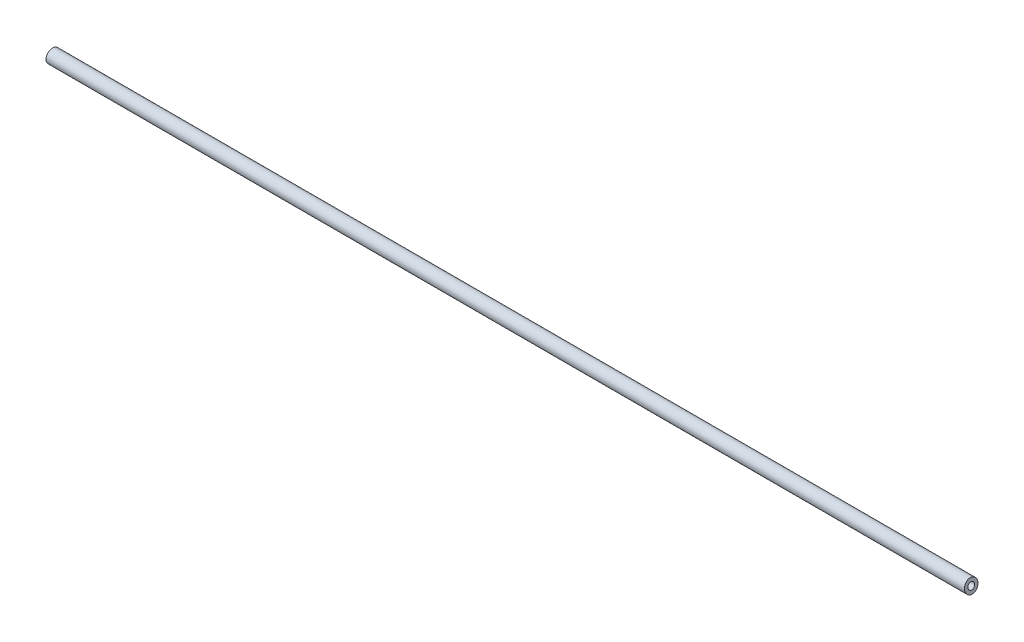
from build123d import *

# Parameters (mm, degrees)
ESQUISSE1_W           = 275
ESQUISSE1_H           = 1
EXTRUSION1_DEPTH      = 216.018603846
EXTRUSION1_DEPTH_BACK = 216.018603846


with BuildPart() as part:
    # Esquisse1 → R_volution1 (revolve)
    with BuildSketch(Plane.XY, mode=Mode.PRIVATE) as r_volution1_sk:
        with Locations((77.5, 1.5)):
            Rectangle(ESQUISSE1_W, ESQUISSE1_H)
    revolve(r_volution1_sk.sketch.rotate(Axis((0, 0, 0), (-1, 0, 0)), 90), axis=Axis((0, 0, 0), (-1, 0, 0)))

    # Esquisse2 → Extrusion1 (cut, two sides: drawn at the far end of the back side and taken through both)
    with BuildSketch(Plane.XY.offset(-EXTRUSION1_DEPTH_BACK)):
        Polygon((297.781869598, -555.906423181), (215, -2), (214.402195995, 2), (131.620326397, 555.906423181), (1239.433172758, 721.470162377), (1405.594715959, -390.342683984), align=None)
    extrude(amount=EXTRUSION1_DEPTH + EXTRUSION1_DEPTH_BACK, mode=Mode.SUBTRACT)


solid = part.part
